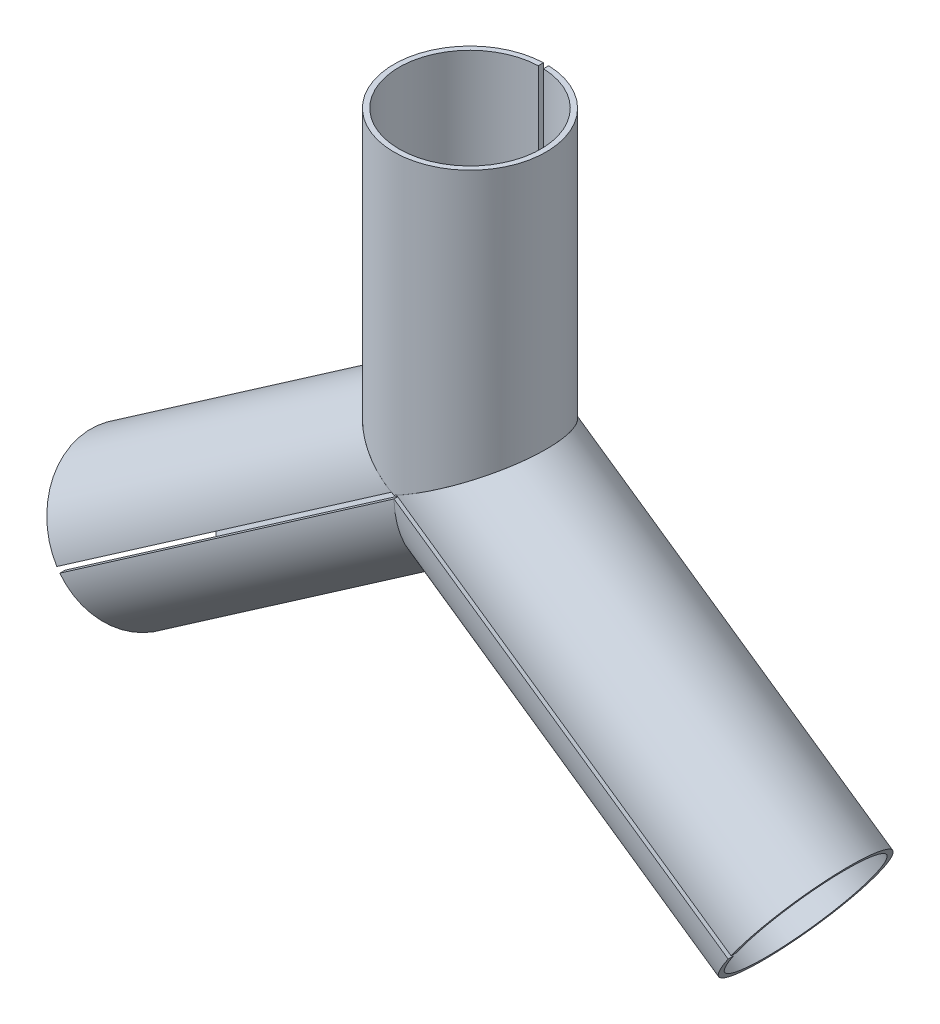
ISO-10303-21;
HEADER;
FILE_DESCRIPTION(('STEP AP214'),'2;1');
FILE_NAME('part.step','',(''),(''),'','','');
FILE_SCHEMA(('AUTOMOTIVE_DESIGN { 1 0 10303 214 1 1 1 1 }'));
ENDSEC;
DATA;
#1=APPLICATION_CONTEXT('core data for automotive mechanical design processes');
#2=APPLICATION_PROTOCOL_DEFINITION('international standard','automotive_design',2000,#1);
#3=PRODUCT_CONTEXT('',#1,'mechanical');
#4=PRODUCT('Part','Part','',(#3));
#5=PRODUCT_RELATED_PRODUCT_CATEGORY('part','',(#4));
#6=PRODUCT_DEFINITION_FORMATION('','',#4);
#7=PRODUCT_DEFINITION_CONTEXT('part definition',#1,'design');
#8=PRODUCT_DEFINITION('design','',#6,#7);
#9=PRODUCT_DEFINITION_SHAPE('','',#8);
#10=(LENGTH_UNIT() NAMED_UNIT(*) SI_UNIT(.MILLI.,.METRE.));
#11=(NAMED_UNIT(*) PLANE_ANGLE_UNIT() SI_UNIT($,.RADIAN.));
#12=(NAMED_UNIT(*) SI_UNIT($,.STERADIAN.) SOLID_ANGLE_UNIT());
#13=UNCERTAINTY_MEASURE_WITH_UNIT(LENGTH_MEASURE(1.E-05),#10,'distance_accuracy_value','');
#14=(GEOMETRIC_REPRESENTATION_CONTEXT(3) GLOBAL_UNCERTAINTY_ASSIGNED_CONTEXT((#13)) GLOBAL_UNIT_ASSIGNED_CONTEXT((#10,
#11,#12)) REPRESENTATION_CONTEXT('',''));
#15=CARTESIAN_POINT('',(0.,0.,0.));
#16=DIRECTION('',(0.,0.,1.));
#17=DIRECTION('',(1.,0.,0.));
#18=AXIS2_PLACEMENT_3D('',#15,#16,#17);
#19=CARTESIAN_POINT('',(0.,0.,0.));
#20=DIRECTION('',(-0.822144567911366,-0.569278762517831,0.));
#21=DIRECTION('',(-0.569278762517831,0.822144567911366,0.));
#22=AXIS2_PLACEMENT_3D('',#19,#20,#21);
#23=CYLINDRICAL_SURFACE('',#22,14.6768756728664);
#24=DIRECTION('',(-0.822144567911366,-0.569278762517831,0.));
#25=VECTOR('',#24,1.);
#26=CARTESIAN_POINT('',(-0.2846393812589,0.411072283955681,14.6683564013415));
#27=LINE('',#26,#25);
#28=CARTESIAN_POINT('',(-65.0340308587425,-44.42344331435,14.6683564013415));
#29=VERTEX_POINT('',#28);
#30=CARTESIAN_POINT('',(-0.499999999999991,0.261949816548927,14.6683564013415));
#31=VERTEX_POINT('',#30);
#32=EDGE_CURVE('E124',#29,#31,#27,.F.);
#33=ORIENTED_EDGE('',*,*,#32,.T.);
#34=CARTESIAN_POINT('',(0.,0.,0.));
#35=DIRECTION('',(0.464069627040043,0.885798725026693,0.));
#36=DIRECTION('',(-0.885798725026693,0.464069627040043,0.));
#37=AXIS2_PLACEMENT_3D('',#34,#35,#36);
#38=ELLIPSE('',#37,16.5690864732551,14.6768756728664);
#39=CARTESIAN_POINT('',(0.,0.,-14.6768756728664));
#40=VERTEX_POINT('',#39);
#41=EDGE_CURVE('E113',#31,#40,#38,.F.);
#42=ORIENTED_EDGE('',*,*,#41,.T.);
#43=CARTESIAN_POINT('',(0.,0.,0.));
#44=DIRECTION('',(1.,0.,0.));
#45=DIRECTION('',(0.,-1.,0.));
#46=AXIS2_PLACEMENT_3D('',#43,#44,#45);
#47=ELLIPSE('',#46,17.8519402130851,14.6768756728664);
#48=CARTESIAN_POINT('',(0.,-0.608165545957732,14.6683564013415));
#49=VERTEX_POINT('',#48);
#50=EDGE_CURVE('E130',#40,#49,#47,.F.);
#51=ORIENTED_EDGE('',*,*,#50,.T.);
#52=DIRECTION('',(-0.822144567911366,-0.569278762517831,0.));
#53=VECTOR('',#52,1.);
#54=CARTESIAN_POINT('',(0.284639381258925,-0.411072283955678,14.6683564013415));
#55=LINE('',#54,#53);
#56=CARTESIAN_POINT('',(-64.4647520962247,-45.2455878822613,14.6683564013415));
#57=VERTEX_POINT('',#56);
#58=EDGE_CURVE('E103',#57,#49,#55,.F.);
#59=ORIENTED_EDGE('',*,*,#58,.F.);
#60=CARTESIAN_POINT('',(-64.7493914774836,-44.8345155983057,0.));
#61=DIRECTION('',(0.822144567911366,0.569278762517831,0.));
#62=DIRECTION('',(-0.569278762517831,0.822144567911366,0.));
#63=AXIS2_PLACEMENT_3D('',#60,#61,#62);
#64=CIRCLE('',#63,14.6768756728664);
#65=EDGE_CURVE('E112',#57,#29,#64,.T.);
#66=ORIENTED_EDGE('',*,*,#65,.T.);
#67=EDGE_LOOP('',(#33,#42,#51,#59,#66));
#68=FACE_BOUND('',#67,.T.);
#69=ADVANCED_FACE('F53',(#68),#23,.T.);
#70=CARTESIAN_POINT('',(0.,0.,-14.6768756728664));
#71=DIRECTION('',(-1.,0.,0.));
#72=DIRECTION('',(0.,0.,-1.));
#73=AXIS2_PLACEMENT_3D('',#70,#71,#72);
#74=PLANE('',#73);
#75=DIRECTION('',(0.,0.,1.));
#76=VECTOR('',#75,1.);
#77=CARTESIAN_POINT('',(0.,-0.608165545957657,-14.6768756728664));
#78=LINE('',#77,#76);
#79=CARTESIAN_POINT('',(0.,-0.60816554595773,13.667733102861));
#80=VERTEX_POINT('',#79);
#81=EDGE_CURVE('E60',#80,#49,#78,.T.);
#82=ORIENTED_EDGE('',*,*,#81,.T.);
#83=ORIENTED_EDGE('',*,*,#50,.F.);
#84=DIRECTION('',(0.,0.,1.));
#85=VECTOR('',#84,1.);
#86=CARTESIAN_POINT('',(0.,0.,-14.6768756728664));
#87=LINE('',#86,#85);
#88=CARTESIAN_POINT('',(0.,0.,-13.6768756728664));
#89=VERTEX_POINT('',#88);
#90=EDGE_CURVE('E127',#40,#89,#87,.T.);
#91=ORIENTED_EDGE('',*,*,#90,.T.);
#92=CARTESIAN_POINT('',(0.,0.,0.));
#93=DIRECTION('',(1.,0.,0.));
#94=DIRECTION('',(0.,-1.,0.));
#95=AXIS2_PLACEMENT_3D('',#92,#93,#94);
#96=ELLIPSE('',#95,16.6356091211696,13.6768756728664);
#97=EDGE_CURVE('E136',#89,#80,#96,.F.);
#98=ORIENTED_EDGE('',*,*,#97,.T.);
#99=EDGE_LOOP('',(#82,#83,#91,#98));
#100=FACE_BOUND('',#99,.T.);
#101=ADVANCED_FACE('F141',(#100),#74,.F.);
#102=CARTESIAN_POINT('',(-64.7493914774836,-44.8345155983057,0.));
#103=DIRECTION('',(-0.822144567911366,-0.569278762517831,0.));
#104=DIRECTION('',(-0.569278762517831,0.822144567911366,0.));
#105=AXIS2_PLACEMENT_3D('',#102,#103,#104);
#106=PLANE('',#105);
#107=DIRECTION('',(0.,0.,1.));
#108=VECTOR('',#107,1.);
#109=CARTESIAN_POINT('',(-65.0340308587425,-44.4234433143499,0.));
#110=LINE('',#109,#108);
#111=CARTESIAN_POINT('',(-65.0340308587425,-44.42344331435,13.667733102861));
#112=VERTEX_POINT('',#111);
#113=EDGE_CURVE('E118',#112,#29,#110,.T.);
#114=ORIENTED_EDGE('',*,*,#113,.T.);
#115=ORIENTED_EDGE('',*,*,#65,.F.);
#116=DIRECTION('',(0.,0.,1.));
#117=VECTOR('',#116,1.);
#118=CARTESIAN_POINT('',(-64.4647520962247,-45.2455878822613,0.));
#119=LINE('',#118,#117);
#120=CARTESIAN_POINT('',(-64.4647520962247,-45.2455878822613,13.667733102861));
#121=VERTEX_POINT('',#120);
#122=EDGE_CURVE('E101',#121,#57,#119,.T.);
#123=ORIENTED_EDGE('',*,*,#122,.F.);
#124=CARTESIAN_POINT('',(-64.7493914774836,-44.8345155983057,0.));
#125=DIRECTION('',(0.822144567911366,0.569278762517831,0.));
#126=DIRECTION('',(0.,0.,-1.));
#127=AXIS2_PLACEMENT_3D('',#124,#125,#126);
#128=CIRCLE('',#127,13.6768756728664);
#129=EDGE_CURVE('E106',#121,#112,#128,.T.);
#130=ORIENTED_EDGE('',*,*,#129,.T.);
#131=EDGE_LOOP('',(#114,#115,#123,#130));
#132=FACE_BOUND('',#131,.T.);
#133=ADVANCED_FACE('F115',(#132),#106,.T.);
#134=CARTESIAN_POINT('',(0.,0.,0.));
#135=DIRECTION('',(-0.822144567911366,-0.569278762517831,0.));
#136=DIRECTION('',(-0.569278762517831,0.822144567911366,0.));
#137=AXIS2_PLACEMENT_3D('',#134,#135,#136);
#138=CYLINDRICAL_SURFACE('',#137,13.6768756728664);
#139=ORIENTED_EDGE('',*,*,#129,.F.);
#140=DIRECTION('',(-0.822144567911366,-0.569278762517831,0.));
#141=VECTOR('',#140,1.);
#142=CARTESIAN_POINT('',(0.284639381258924,-0.411072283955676,13.667733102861));
#143=LINE('',#142,#141);
#144=EDGE_CURVE('E73',#121,#80,#143,.F.);
#145=ORIENTED_EDGE('',*,*,#144,.T.);
#146=ORIENTED_EDGE('',*,*,#97,.F.);
#147=CARTESIAN_POINT('',(0.,0.,0.));
#148=DIRECTION('',(0.464069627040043,0.885798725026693,0.));
#149=DIRECTION('',(-0.885798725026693,0.464069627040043,0.));
#150=AXIS2_PLACEMENT_3D('',#147,#148,#149);
#151=ELLIPSE('',#150,15.4401618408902,13.6768756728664);
#152=CARTESIAN_POINT('',(-0.499999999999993,0.261949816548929,13.667733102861));
#153=VERTEX_POINT('',#152);
#154=EDGE_CURVE('E138',#153,#89,#151,.F.);
#155=ORIENTED_EDGE('',*,*,#154,.F.);
#156=DIRECTION('',(-0.822144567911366,-0.569278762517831,0.));
#157=VECTOR('',#156,1.);
#158=CARTESIAN_POINT('',(-0.284639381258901,0.411072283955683,13.667733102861));
#159=LINE('',#158,#157);
#160=EDGE_CURVE('E109',#112,#153,#159,.F.);
#161=ORIENTED_EDGE('',*,*,#160,.F.);
#162=EDGE_LOOP('',(#139,#145,#146,#155,#161));
#163=FACE_BOUND('',#162,.T.);
#164=ADVANCED_FACE('F107',(#163),#138,.F.);
#165=CARTESIAN_POINT('',(-29.3537513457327,15.3784195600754,-14.6768756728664));
#166=DIRECTION('',(-0.464069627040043,-0.885798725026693,0.));
#167=DIRECTION('',(-0.885798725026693,0.464069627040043,0.));
#168=AXIS2_PLACEMENT_3D('',#165,#166,#167);
#169=PLANE('',#168);
#170=ORIENTED_EDGE('',*,*,#154,.T.);
#171=ORIENTED_EDGE('',*,*,#90,.F.);
#172=ORIENTED_EDGE('',*,*,#41,.F.);
#173=DIRECTION('',(0.,0.,1.));
#174=VECTOR('',#173,1.);
#175=CARTESIAN_POINT('',(-0.500000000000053,0.26194981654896,-14.6768756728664));
#176=LINE('',#175,#174);
#177=EDGE_CURVE('E13',#153,#31,#176,.T.);
#178=ORIENTED_EDGE('',*,*,#177,.F.);
#179=EDGE_LOOP('',(#170,#171,#172,#178));
#180=FACE_BOUND('',#179,.T.);
#181=ADVANCED_FACE('F144',(#180),#169,.F.);
#182=CARTESIAN_POINT('',(37.0434120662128,25.0418583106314,0.));
#183=DIRECTION('',(-0.569278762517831,0.822144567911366,0.));
#184=DIRECTION('',(0.822144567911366,0.569278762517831,0.));
#185=AXIS2_PLACEMENT_3D('',#182,#183,#184);
#186=PLANE('',#185);
#187=ORIENTED_EDGE('',*,*,#122,.T.);
#188=ORIENTED_EDGE('',*,*,#58,.T.);
#189=ORIENTED_EDGE('',*,*,#81,.F.);
#190=ORIENTED_EDGE('',*,*,#144,.F.);
#191=EDGE_LOOP('',(#187,#188,#189,#190));
#192=FACE_BOUND('',#191,.T.);
#193=ADVANCED_FACE('F98',(#192),#186,.T.);
#194=CARTESIAN_POINT('',(36.4741333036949,25.8640028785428,0.));
#195=DIRECTION('',(-0.569278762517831,0.822144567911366,0.));
#196=DIRECTION('',(0.822144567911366,0.569278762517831,0.));
#197=AXIS2_PLACEMENT_3D('',#194,#195,#196);
#198=PLANE('',#197);
#199=ORIENTED_EDGE('',*,*,#32,.F.);
#200=ORIENTED_EDGE('',*,*,#113,.F.);
#201=ORIENTED_EDGE('',*,*,#160,.T.);
#202=ORIENTED_EDGE('',*,*,#177,.T.);
#203=EDGE_LOOP('',(#199,#200,#201,#202));
#204=FACE_BOUND('',#203,.T.);
#205=ADVANCED_FACE('F145',(#204),#198,.F.);
#206=CLOSED_SHELL('',(#69,#101,#133,#164,#181,#193,#205));
#207=MANIFOLD_SOLID_BREP('B2',#206);
#208=CARTESIAN_POINT('',(0.,0.,0.));
#209=DIRECTION('',(0.822144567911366,-0.569278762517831,0.));
#210=DIRECTION('',(0.569278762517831,0.822144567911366,0.));
#211=AXIS2_PLACEMENT_3D('',#208,#209,#210);
#212=CYLINDRICAL_SURFACE('',#211,14.6768756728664);
#213=DIRECTION('',(0.822144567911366,-0.569278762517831,0.));
#214=VECTOR('',#213,1.);
#215=CARTESIAN_POINT('',(0.2846393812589,0.411072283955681,14.6683564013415));
#216=LINE('',#215,#214);
#217=CARTESIAN_POINT('',(65.0340308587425,-44.42344331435,14.6683564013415));
#218=VERTEX_POINT('',#217);
#219=CARTESIAN_POINT('',(0.499999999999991,0.261949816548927,14.6683564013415));
#220=VERTEX_POINT('',#219);
#221=EDGE_CURVE('E225',#218,#220,#216,.F.);
#222=ORIENTED_EDGE('',*,*,#221,.F.);
#223=CARTESIAN_POINT('',(64.7493914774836,-44.8345155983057,0.));
#224=DIRECTION('',(0.822144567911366,-0.569278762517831,0.));
#225=DIRECTION('',(0.569278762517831,0.822144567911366,0.));
#226=AXIS2_PLACEMENT_3D('',#223,#224,#225);
#227=CIRCLE('',#226,14.6768756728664);
#228=CARTESIAN_POINT('',(64.4647520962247,-45.2455878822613,14.6683564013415));
#229=VERTEX_POINT('',#228);
#230=EDGE_CURVE('E275',#229,#218,#227,.T.);
#231=ORIENTED_EDGE('',*,*,#230,.F.);
#232=DIRECTION('',(0.822144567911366,-0.569278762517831,0.));
#233=VECTOR('',#232,1.);
#234=CARTESIAN_POINT('',(-0.284639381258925,-0.411072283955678,14.6683564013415));
#235=LINE('',#234,#233);
#236=CARTESIAN_POINT('',(0.,-0.608165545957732,14.6683564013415));
#237=VERTEX_POINT('',#236);
#238=EDGE_CURVE('E257',#229,#237,#235,.F.);
#239=ORIENTED_EDGE('',*,*,#238,.T.);
#240=CARTESIAN_POINT('',(0.,0.,0.));
#241=DIRECTION('',(1.,0.,0.));
#242=DIRECTION('',(0.,-1.,0.));
#243=AXIS2_PLACEMENT_3D('',#240,#241,#242);
#244=ELLIPSE('',#243,17.8519402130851,14.6768756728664);
#245=CARTESIAN_POINT('',(0.,0.,-14.6768756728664));
#246=VERTEX_POINT('',#245);
#247=EDGE_CURVE('E279',#246,#237,#244,.F.);
#248=ORIENTED_EDGE('',*,*,#247,.F.);
#249=CARTESIAN_POINT('',(0.,0.,0.));
#250=DIRECTION('',(0.464069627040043,-0.885798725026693,0.));
#251=DIRECTION('',(0.885798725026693,0.464069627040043,0.));
#252=AXIS2_PLACEMENT_3D('',#249,#250,#251);
#253=ELLIPSE('',#252,16.5690864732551,14.6768756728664);
#254=EDGE_CURVE('E276',#220,#246,#253,.F.);
#255=ORIENTED_EDGE('',*,*,#254,.F.);
#256=EDGE_LOOP('',(#222,#231,#239,#248,#255));
#257=FACE_BOUND('',#256,.T.);
#258=ADVANCED_FACE('F211',(#257),#212,.T.);
#259=CARTESIAN_POINT('',(0.,0.,-14.6768756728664));
#260=DIRECTION('',(1.,0.,0.));
#261=DIRECTION('',(0.,0.,-1.));
#262=AXIS2_PLACEMENT_3D('',#259,#260,#261);
#263=PLANE('',#262);
#264=DIRECTION('',(0.,0.,1.));
#265=VECTOR('',#264,1.);
#266=CARTESIAN_POINT('',(0.,-0.608165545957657,-14.6768756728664));
#267=LINE('',#266,#265);
#268=CARTESIAN_POINT('',(0.,-0.60816554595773,13.667733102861));
#269=VERTEX_POINT('',#268);
#270=EDGE_CURVE('E218',#269,#237,#267,.T.);
#271=ORIENTED_EDGE('',*,*,#270,.F.);
#272=CARTESIAN_POINT('',(0.,0.,0.));
#273=DIRECTION('',(1.,0.,0.));
#274=DIRECTION('',(0.,-1.,0.));
#275=AXIS2_PLACEMENT_3D('',#272,#273,#274);
#276=ELLIPSE('',#275,16.6356091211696,13.6768756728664);
#277=CARTESIAN_POINT('',(0.,0.,-13.6768756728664));
#278=VERTEX_POINT('',#277);
#279=EDGE_CURVE('E271',#278,#269,#276,.F.);
#280=ORIENTED_EDGE('',*,*,#279,.F.);
#281=DIRECTION('',(0.,0.,1.));
#282=VECTOR('',#281,1.);
#283=CARTESIAN_POINT('',(0.,0.,-14.6768756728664));
#284=LINE('',#283,#282);
#285=EDGE_CURVE('E295',#246,#278,#284,.T.);
#286=ORIENTED_EDGE('',*,*,#285,.F.);
#287=ORIENTED_EDGE('',*,*,#247,.T.);
#288=EDGE_LOOP('',(#271,#280,#286,#287));
#289=FACE_BOUND('',#288,.T.);
#290=ADVANCED_FACE('F293',(#289),#263,.F.);
#291=CARTESIAN_POINT('',(64.7493914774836,-44.8345155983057,0.));
#292=DIRECTION('',(0.822144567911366,-0.569278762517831,0.));
#293=DIRECTION('',(0.569278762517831,0.822144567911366,0.));
#294=AXIS2_PLACEMENT_3D('',#291,#292,#293);
#295=PLANE('',#294);
#296=DIRECTION('',(0.,0.,1.));
#297=VECTOR('',#296,1.);
#298=CARTESIAN_POINT('',(65.0340308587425,-44.4234433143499,0.));
#299=LINE('',#298,#297);
#300=CARTESIAN_POINT('',(65.0340308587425,-44.42344331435,13.667733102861));
#301=VERTEX_POINT('',#300);
#302=EDGE_CURVE('E262',#301,#218,#299,.T.);
#303=ORIENTED_EDGE('',*,*,#302,.F.);
#304=CARTESIAN_POINT('',(64.7493914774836,-44.8345155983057,0.));
#305=DIRECTION('',(0.822144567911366,-0.569278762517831,0.));
#306=DIRECTION('',(0.,0.,-1.));
#307=AXIS2_PLACEMENT_3D('',#304,#305,#306);
#308=CIRCLE('',#307,13.6768756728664);
#309=CARTESIAN_POINT('',(64.4647520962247,-45.2455878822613,13.667733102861));
#310=VERTEX_POINT('',#309);
#311=EDGE_CURVE('E269',#310,#301,#308,.T.);
#312=ORIENTED_EDGE('',*,*,#311,.F.);
#313=DIRECTION('',(0.,0.,1.));
#314=VECTOR('',#313,1.);
#315=CARTESIAN_POINT('',(64.4647520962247,-45.2455878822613,0.));
#316=LINE('',#315,#314);
#317=EDGE_CURVE('E254',#310,#229,#316,.T.);
#318=ORIENTED_EDGE('',*,*,#317,.T.);
#319=ORIENTED_EDGE('',*,*,#230,.T.);
#320=EDGE_LOOP('',(#303,#312,#318,#319));
#321=FACE_BOUND('',#320,.T.);
#322=ADVANCED_FACE('F274',(#321),#295,.T.);
#323=CARTESIAN_POINT('',(0.,0.,0.));
#324=DIRECTION('',(0.822144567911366,-0.569278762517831,0.));
#325=DIRECTION('',(0.569278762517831,0.822144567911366,0.));
#326=AXIS2_PLACEMENT_3D('',#323,#324,#325);
#327=CYLINDRICAL_SURFACE('',#326,13.6768756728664);
#328=ORIENTED_EDGE('',*,*,#311,.T.);
#329=DIRECTION('',(0.822144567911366,-0.569278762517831,0.));
#330=VECTOR('',#329,1.);
#331=CARTESIAN_POINT('',(0.284639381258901,0.411072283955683,13.667733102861));
#332=LINE('',#331,#330);
#333=CARTESIAN_POINT('',(0.499999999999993,0.261949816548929,13.667733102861));
#334=VERTEX_POINT('',#333);
#335=EDGE_CURVE('E290',#301,#334,#332,.F.);
#336=ORIENTED_EDGE('',*,*,#335,.T.);
#337=CARTESIAN_POINT('',(0.,0.,0.));
#338=DIRECTION('',(0.464069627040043,-0.885798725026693,0.));
#339=DIRECTION('',(0.885798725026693,0.464069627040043,0.));
#340=AXIS2_PLACEMENT_3D('',#337,#338,#339);
#341=ELLIPSE('',#340,15.4401618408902,13.6768756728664);
#342=EDGE_CURVE('E284',#334,#278,#341,.F.);
#343=ORIENTED_EDGE('',*,*,#342,.T.);
#344=ORIENTED_EDGE('',*,*,#279,.T.);
#345=DIRECTION('',(0.822144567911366,-0.569278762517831,0.));
#346=VECTOR('',#345,1.);
#347=CARTESIAN_POINT('',(-0.284639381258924,-0.411072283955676,13.667733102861));
#348=LINE('',#347,#346);
#349=EDGE_CURVE('E232',#310,#269,#348,.F.);
#350=ORIENTED_EDGE('',*,*,#349,.F.);
#351=EDGE_LOOP('',(#328,#336,#343,#344,#350));
#352=FACE_BOUND('',#351,.T.);
#353=ADVANCED_FACE('F267',(#352),#327,.F.);
#354=CARTESIAN_POINT('',(29.3537513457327,15.3784195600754,-14.6768756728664));
#355=DIRECTION('',(0.464069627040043,-0.885798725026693,0.));
#356=DIRECTION('',(0.885798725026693,0.464069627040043,0.));
#357=AXIS2_PLACEMENT_3D('',#354,#355,#356);
#358=PLANE('',#357);
#359=ORIENTED_EDGE('',*,*,#342,.F.);
#360=DIRECTION('',(0.,0.,1.));
#361=VECTOR('',#360,1.);
#362=CARTESIAN_POINT('',(0.500000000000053,0.26194981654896,-14.6768756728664));
#363=LINE('',#362,#361);
#364=EDGE_CURVE('E51',#334,#220,#363,.T.);
#365=ORIENTED_EDGE('',*,*,#364,.T.);
#366=ORIENTED_EDGE('',*,*,#254,.T.);
#367=ORIENTED_EDGE('',*,*,#285,.T.);
#368=EDGE_LOOP('',(#359,#365,#366,#367));
#369=FACE_BOUND('',#368,.T.);
#370=ADVANCED_FACE('F303',(#369),#358,.F.);
#371=CARTESIAN_POINT('',(-37.0434120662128,25.0418583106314,0.));
#372=DIRECTION('',(0.569278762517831,0.822144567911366,0.));
#373=DIRECTION('',(-0.822144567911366,0.569278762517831,0.));
#374=AXIS2_PLACEMENT_3D('',#371,#372,#373);
#375=PLANE('',#374);
#376=ORIENTED_EDGE('',*,*,#317,.F.);
#377=ORIENTED_EDGE('',*,*,#349,.T.);
#378=ORIENTED_EDGE('',*,*,#270,.T.);
#379=ORIENTED_EDGE('',*,*,#238,.F.);
#380=EDGE_LOOP('',(#376,#377,#378,#379));
#381=FACE_BOUND('',#380,.T.);
#382=ADVANCED_FACE('F255',(#381),#375,.T.);
#383=CARTESIAN_POINT('',(-36.4741333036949,25.8640028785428,0.));
#384=DIRECTION('',(0.569278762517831,0.822144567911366,0.));
#385=DIRECTION('',(-0.822144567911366,0.569278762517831,0.));
#386=AXIS2_PLACEMENT_3D('',#383,#384,#385);
#387=PLANE('',#386);
#388=ORIENTED_EDGE('',*,*,#221,.T.);
#389=ORIENTED_EDGE('',*,*,#364,.F.);
#390=ORIENTED_EDGE('',*,*,#335,.F.);
#391=ORIENTED_EDGE('',*,*,#302,.T.);
#392=EDGE_LOOP('',(#388,#389,#390,#391));
#393=FACE_BOUND('',#392,.T.);
#394=ADVANCED_FACE('F300',(#393),#387,.F.);
#395=CLOSED_SHELL('',(#258,#290,#322,#353,#370,#382,#394));
#396=MANIFOLD_SOLID_BREP('B7',#395);
#397=CARTESIAN_POINT('',(0.,57.343302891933,0.));
#398=DIRECTION('',(0.,-1.,0.));
#399=DIRECTION('',(0.,0.,-1.));
#400=AXIS2_PLACEMENT_3D('',#397,#398,#399);
#401=CYLINDRICAL_SURFACE('',#400,14.6768756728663);
#402=CARTESIAN_POINT('',(0.,0.,0.));
#403=DIRECTION('',(-0.464069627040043,0.885798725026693,0.));
#404=DIRECTION('',(-0.885798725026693,-0.464069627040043,0.));
#405=AXIS2_PLACEMENT_3D('',#402,#403,#404);
#406=ELLIPSE('',#405,16.569086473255,14.6768756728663);
#407=CARTESIAN_POINT('',(0.,0.,14.6768756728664));
#408=VERTEX_POINT('',#407);
#409=CARTESIAN_POINT('',(0.5,0.261949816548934,-14.6683564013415));
#410=VERTEX_POINT('',#409);
#411=EDGE_CURVE('E419',#408,#410,#406,.T.);
#412=ORIENTED_EDGE('',*,*,#411,.T.);
#413=DIRECTION('',(0.,-1.,0.));
#414=VECTOR('',#413,1.);
#415=CARTESIAN_POINT('',(0.5,57.343302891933,-14.6683564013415));
#416=LINE('',#415,#414);
#417=CARTESIAN_POINT('',(0.5,57.343302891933,-14.6683564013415));
#418=VERTEX_POINT('',#417);
#419=EDGE_CURVE('E381',#410,#418,#416,.F.);
#420=ORIENTED_EDGE('',*,*,#419,.T.);
#421=CARTESIAN_POINT('',(0.,57.343302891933,0.));
#422=DIRECTION('',(0.,1.,0.));
#423=DIRECTION('',(0.,0.,1.));
#424=AXIS2_PLACEMENT_3D('',#421,#422,#423);
#425=CIRCLE('',#424,14.6768756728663);
#426=CARTESIAN_POINT('',(-0.5,57.343302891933,-14.6683564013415));
#427=VERTEX_POINT('',#426);
#428=EDGE_CURVE('E417',#427,#418,#425,.T.);
#429=ORIENTED_EDGE('',*,*,#428,.F.);
#430=DIRECTION('',(0.,-1.,0.));
#431=VECTOR('',#430,1.);
#432=CARTESIAN_POINT('',(-0.5,57.343302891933,-14.6683564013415));
#433=LINE('',#432,#431);
#434=CARTESIAN_POINT('',(-0.499999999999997,0.261949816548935,-14.6683564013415));
#435=VERTEX_POINT('',#434);
#436=EDGE_CURVE('E445',#435,#427,#433,.F.);
#437=ORIENTED_EDGE('',*,*,#436,.F.);
#438=CARTESIAN_POINT('',(0.,0.,0.));
#439=DIRECTION('',(0.464069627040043,0.885798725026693,0.));
#440=DIRECTION('',(0.885798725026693,-0.464069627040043,0.));
#441=AXIS2_PLACEMENT_3D('',#438,#439,#440);
#442=ELLIPSE('',#441,16.569086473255,14.6768756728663);
#443=EDGE_CURVE('E429',#435,#408,#442,.T.);
#444=ORIENTED_EDGE('',*,*,#443,.T.);
#445=EDGE_LOOP('',(#412,#420,#429,#437,#444));
#446=FACE_BOUND('',#445,.T.);
#447=ADVANCED_FACE('F360',(#446),#401,.T.);
#448=CARTESIAN_POINT('',(-29.3537513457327,15.3784195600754,-14.6768756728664));
#449=DIRECTION('',(0.464069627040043,0.885798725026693,0.));
#450=DIRECTION('',(-0.885798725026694,0.464069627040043,0.));
#451=AXIS2_PLACEMENT_3D('',#448,#449,#450);
#452=PLANE('',#451);
#453=DIRECTION('',(0.,0.,-1.));
#454=VECTOR('',#453,1.);
#455=CARTESIAN_POINT('',(-0.499999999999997,0.261949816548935,-14.6768756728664));
#456=LINE('',#455,#454);
#457=CARTESIAN_POINT('',(-0.499999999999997,0.261949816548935,-13.667733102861));
#458=VERTEX_POINT('',#457);
#459=EDGE_CURVE('E209',#458,#435,#456,.T.);
#460=ORIENTED_EDGE('',*,*,#459,.F.);
#461=CARTESIAN_POINT('',(0.,0.,0.));
#462=DIRECTION('',(0.464069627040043,0.885798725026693,0.));
#463=DIRECTION('',(0.885798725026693,-0.464069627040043,0.));
#464=AXIS2_PLACEMENT_3D('',#461,#462,#463);
#465=ELLIPSE('',#464,15.4401618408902,13.6768756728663);
#466=CARTESIAN_POINT('',(0.,0.,13.6768756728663));
#467=VERTEX_POINT('',#466);
#468=EDGE_CURVE('E427',#458,#467,#465,.T.);
#469=ORIENTED_EDGE('',*,*,#468,.T.);
#470=DIRECTION('',(0.,0.,1.));
#471=VECTOR('',#470,1.);
#472=CARTESIAN_POINT('',(0.,0.,-14.6768756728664));
#473=LINE('',#472,#471);
#474=EDGE_CURVE('E447',#467,#408,#473,.T.);
#475=ORIENTED_EDGE('',*,*,#474,.T.);
#476=ORIENTED_EDGE('',*,*,#443,.F.);
#477=EDGE_LOOP('',(#460,#469,#475,#476));
#478=FACE_BOUND('',#477,.T.);
#479=ADVANCED_FACE('F451',(#478),#452,.F.);
#480=CARTESIAN_POINT('',(0.,57.343302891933,0.));
#481=DIRECTION('',(0.,1.,0.));
#482=DIRECTION('',(0.,0.,1.));
#483=AXIS2_PLACEMENT_3D('',#480,#481,#482);
#484=PLANE('',#483);
#485=DIRECTION('',(0.,0.,1.));
#486=VECTOR('',#485,1.);
#487=CARTESIAN_POINT('',(0.5,57.343302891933,-14.6768756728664));
#488=LINE('',#487,#486);
#489=CARTESIAN_POINT('',(0.5,57.343302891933,-13.667733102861));
#490=VERTEX_POINT('',#489);
#491=EDGE_CURVE('E403',#418,#490,#488,.T.);
#492=ORIENTED_EDGE('',*,*,#491,.T.);
#493=CARTESIAN_POINT('',(0.,57.343302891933,0.));
#494=DIRECTION('',(0.,1.,0.));
#495=DIRECTION('',(1.,0.,0.));
#496=AXIS2_PLACEMENT_3D('',#493,#494,#495);
#497=CIRCLE('',#496,13.6768756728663);
#498=CARTESIAN_POINT('',(-0.5,57.343302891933,-13.667733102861));
#499=VERTEX_POINT('',#498);
#500=EDGE_CURVE('E424',#499,#490,#497,.T.);
#501=ORIENTED_EDGE('',*,*,#500,.F.);
#502=DIRECTION('',(0.,0.,1.));
#503=VECTOR('',#502,1.);
#504=CARTESIAN_POINT('',(-0.5,57.343302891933,-14.6768756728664));
#505=LINE('',#504,#503);
#506=EDGE_CURVE('E411',#427,#499,#505,.T.);
#507=ORIENTED_EDGE('',*,*,#506,.F.);
#508=ORIENTED_EDGE('',*,*,#428,.T.);
#509=EDGE_LOOP('',(#492,#501,#507,#508));
#510=FACE_BOUND('',#509,.T.);
#511=ADVANCED_FACE('F422',(#510),#484,.T.);
#512=CARTESIAN_POINT('',(0.,57.343302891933,0.));
#513=DIRECTION('',(0.,-1.,0.));
#514=DIRECTION('',(0.,0.,-1.));
#515=AXIS2_PLACEMENT_3D('',#512,#513,#514);
#516=CYLINDRICAL_SURFACE('',#515,13.6768756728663);
#517=DIRECTION('',(0.,-1.,0.));
#518=VECTOR('',#517,1.);
#519=CARTESIAN_POINT('',(0.5,57.343302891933,-13.667733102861));
#520=LINE('',#519,#518);
#521=CARTESIAN_POINT('',(0.5,0.261949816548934,-13.667733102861));
#522=VERTEX_POINT('',#521);
#523=EDGE_CURVE('E406',#522,#490,#520,.F.);
#524=ORIENTED_EDGE('',*,*,#523,.F.);
#525=CARTESIAN_POINT('',(0.,0.,0.));
#526=DIRECTION('',(-0.464069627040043,0.885798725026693,0.));
#527=DIRECTION('',(-0.885798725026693,-0.464069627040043,0.));
#528=AXIS2_PLACEMENT_3D('',#525,#526,#527);
#529=ELLIPSE('',#528,15.4401618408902,13.6768756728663);
#530=EDGE_CURVE('E423',#467,#522,#529,.T.);
#531=ORIENTED_EDGE('',*,*,#530,.F.);
#532=ORIENTED_EDGE('',*,*,#468,.F.);
#533=DIRECTION('',(0.,-1.,0.));
#534=VECTOR('',#533,1.);
#535=CARTESIAN_POINT('',(-0.5,57.343302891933,-13.667733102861));
#536=LINE('',#535,#534);
#537=EDGE_CURVE('E373',#458,#499,#536,.F.);
#538=ORIENTED_EDGE('',*,*,#537,.T.);
#539=ORIENTED_EDGE('',*,*,#500,.T.);
#540=EDGE_LOOP('',(#524,#531,#532,#538,#539));
#541=FACE_BOUND('',#540,.T.);
#542=ADVANCED_FACE('F439',(#541),#516,.F.);
#543=CARTESIAN_POINT('',(0.,0.,-14.6768756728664));
#544=DIRECTION('',(-0.464069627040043,0.885798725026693,0.));
#545=DIRECTION('',(-0.885798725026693,-0.464069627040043,0.));
#546=AXIS2_PLACEMENT_3D('',#543,#544,#545);
#547=PLANE('',#546);
#548=ORIENTED_EDGE('',*,*,#530,.T.);
#549=DIRECTION('',(0.,0.,-1.));
#550=VECTOR('',#549,1.);
#551=CARTESIAN_POINT('',(0.5,0.261949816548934,-14.6768756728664));
#552=LINE('',#551,#550);
#553=EDGE_CURVE('E367',#522,#410,#552,.T.);
#554=ORIENTED_EDGE('',*,*,#553,.T.);
#555=ORIENTED_EDGE('',*,*,#411,.F.);
#556=ORIENTED_EDGE('',*,*,#474,.F.);
#557=EDGE_LOOP('',(#548,#554,#555,#556));
#558=FACE_BOUND('',#557,.T.);
#559=ADVANCED_FACE('F434',(#558),#547,.F.);
#560=CARTESIAN_POINT('',(0.5,0.,-14.6768756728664));
#561=DIRECTION('',(1.,0.,0.));
#562=DIRECTION('',(0.,0.,-1.));
#563=AXIS2_PLACEMENT_3D('',#560,#561,#562);
#564=PLANE('',#563);
#565=ORIENTED_EDGE('',*,*,#553,.F.);
#566=ORIENTED_EDGE('',*,*,#523,.T.);
#567=ORIENTED_EDGE('',*,*,#491,.F.);
#568=ORIENTED_EDGE('',*,*,#419,.F.);
#569=EDGE_LOOP('',(#565,#566,#567,#568));
#570=FACE_BOUND('',#569,.T.);
#571=ADVANCED_FACE('F404',(#570),#564,.F.);
#572=CARTESIAN_POINT('',(-0.5,0.,-14.6768756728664));
#573=DIRECTION('',(1.,0.,0.));
#574=DIRECTION('',(0.,0.,-1.));
#575=AXIS2_PLACEMENT_3D('',#572,#573,#574);
#576=PLANE('',#575);
#577=ORIENTED_EDGE('',*,*,#436,.T.);
#578=ORIENTED_EDGE('',*,*,#506,.T.);
#579=ORIENTED_EDGE('',*,*,#537,.F.);
#580=ORIENTED_EDGE('',*,*,#459,.T.);
#581=EDGE_LOOP('',(#577,#578,#579,#580));
#582=FACE_BOUND('',#581,.T.);
#583=ADVANCED_FACE('F452',(#582),#576,.T.);
#584=CLOSED_SHELL('',(#447,#479,#511,#542,#559,#571,#583));
#585=MANIFOLD_SOLID_BREP('B45',#584);
#586=ADVANCED_BREP_SHAPE_REPRESENTATION('',(#18,#207,#396,#585),#14);
#587=SHAPE_DEFINITION_REPRESENTATION(#9,#586);
ENDSEC;
END-ISO-10303-21;
